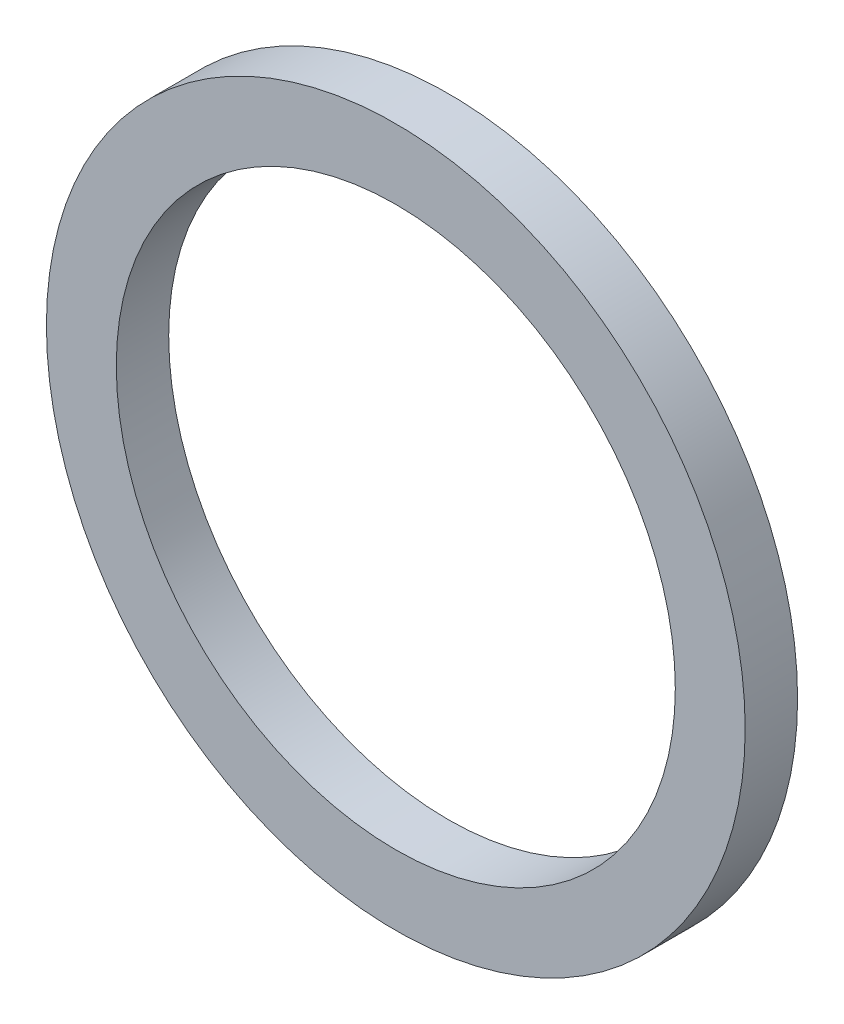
ISO-10303-21;
HEADER;
FILE_DESCRIPTION(('STEP AP214'),'2;1');
FILE_NAME('part.step','',(''),(''),'','','');
FILE_SCHEMA(('AUTOMOTIVE_DESIGN { 1 0 10303 214 1 1 1 1 }'));
ENDSEC;
DATA;
#1=APPLICATION_CONTEXT('core data for automotive mechanical design processes');
#2=APPLICATION_PROTOCOL_DEFINITION('international standard','automotive_design',2000,#1);
#3=PRODUCT_CONTEXT('',#1,'mechanical');
#4=PRODUCT('Part','Part','',(#3));
#5=PRODUCT_RELATED_PRODUCT_CATEGORY('part','',(#4));
#6=PRODUCT_DEFINITION_FORMATION('','',#4);
#7=PRODUCT_DEFINITION_CONTEXT('part definition',#1,'design');
#8=PRODUCT_DEFINITION('design','',#6,#7);
#9=PRODUCT_DEFINITION_SHAPE('','',#8);
#10=(LENGTH_UNIT() NAMED_UNIT(*) SI_UNIT(.MILLI.,.METRE.));
#11=(NAMED_UNIT(*) PLANE_ANGLE_UNIT() SI_UNIT($,.RADIAN.));
#12=(NAMED_UNIT(*) SI_UNIT($,.STERADIAN.) SOLID_ANGLE_UNIT());
#13=UNCERTAINTY_MEASURE_WITH_UNIT(LENGTH_MEASURE(1.E-05),#10,'distance_accuracy_value','');
#14=(GEOMETRIC_REPRESENTATION_CONTEXT(3) GLOBAL_UNCERTAINTY_ASSIGNED_CONTEXT((#13)) GLOBAL_UNIT_ASSIGNED_CONTEXT((#10,
#11,#12)) REPRESENTATION_CONTEXT('',''));
#15=CARTESIAN_POINT('',(0.,0.,0.));
#16=DIRECTION('',(0.,0.,1.));
#17=DIRECTION('',(1.,0.,0.));
#18=AXIS2_PLACEMENT_3D('',#15,#16,#17);
#19=CARTESIAN_POINT('',(0.,0.,3.));
#20=DIRECTION('',(0.,0.,1.));
#21=DIRECTION('',(1.,0.,0.));
#22=AXIS2_PLACEMENT_3D('',#19,#20,#21);
#23=PLANE('',#22);
#24=CARTESIAN_POINT('',(0.,0.,3.));
#25=DIRECTION('',(0.,0.,1.));
#26=DIRECTION('',(1.,0.,0.));
#27=AXIS2_PLACEMENT_3D('',#24,#25,#26);
#28=CIRCLE('',#27,20.);
#29=CARTESIAN_POINT('',(20.,0.,3.));
#30=VERTEX_POINT('',#29);
#31=EDGE_CURVE('E10',#30,#30,#28,.T.);
#32=ORIENTED_EDGE('',*,*,#31,.T.);
#33=EDGE_LOOP('',(#32));
#34=FACE_BOUND('',#33,.T.);
#35=CARTESIAN_POINT('',(0.,0.,3.));
#36=DIRECTION('',(0.,0.,1.));
#37=DIRECTION('',(1.,0.,0.));
#38=AXIS2_PLACEMENT_3D('',#35,#36,#37);
#39=CIRCLE('',#38,16.);
#40=CARTESIAN_POINT('',(16.,0.,3.));
#41=VERTEX_POINT('',#40);
#42=EDGE_CURVE('E33',#41,#41,#39,.T.);
#43=ORIENTED_EDGE('',*,*,#42,.F.);
#44=EDGE_LOOP('',(#43));
#45=FACE_BOUND('',#44,.T.);
#46=ADVANCED_FACE('F22',(#34,#45),#23,.T.);
#47=CARTESIAN_POINT('',(0.,0.,0.));
#48=DIRECTION('',(0.,0.,1.));
#49=DIRECTION('',(1.,0.,0.));
#50=AXIS2_PLACEMENT_3D('',#47,#48,#49);
#51=PLANE('',#50);
#52=CARTESIAN_POINT('',(0.,0.,0.));
#53=DIRECTION('',(0.,0.,1.));
#54=DIRECTION('',(1.,0.,0.));
#55=AXIS2_PLACEMENT_3D('',#52,#53,#54);
#56=CIRCLE('',#55,20.);
#57=CARTESIAN_POINT('',(20.,0.,0.));
#58=VERTEX_POINT('',#57);
#59=EDGE_CURVE('E29',#58,#58,#56,.T.);
#60=ORIENTED_EDGE('',*,*,#59,.F.);
#61=EDGE_LOOP('',(#60));
#62=FACE_BOUND('',#61,.T.);
#63=CARTESIAN_POINT('',(0.,0.,0.));
#64=DIRECTION('',(0.,0.,1.));
#65=DIRECTION('',(1.,0.,0.));
#66=AXIS2_PLACEMENT_3D('',#63,#64,#65);
#67=CIRCLE('',#66,16.);
#68=CARTESIAN_POINT('',(16.,0.,0.));
#69=VERTEX_POINT('',#68);
#70=EDGE_CURVE('E37',#69,#69,#67,.T.);
#71=ORIENTED_EDGE('',*,*,#70,.T.);
#72=EDGE_LOOP('',(#71));
#73=FACE_BOUND('',#72,.T.);
#74=ADVANCED_FACE('F43',(#62,#73),#51,.F.);
#75=CARTESIAN_POINT('',(0.,0.,3.));
#76=DIRECTION('',(0.,0.,-1.));
#77=DIRECTION('',(-1.,0.,0.));
#78=AXIS2_PLACEMENT_3D('',#75,#76,#77);
#79=CYLINDRICAL_SURFACE('',#78,20.);
#80=ORIENTED_EDGE('',*,*,#31,.F.);
#81=EDGE_LOOP('',(#80));
#82=FACE_BOUND('',#81,.T.);
#83=ORIENTED_EDGE('',*,*,#59,.T.);
#84=EDGE_LOOP('',(#83));
#85=FACE_BOUND('',#84,.T.);
#86=ADVANCED_FACE('F24',(#82,#85),#79,.T.);
#87=CARTESIAN_POINT('',(0.,0.,3.));
#88=DIRECTION('',(0.,0.,-1.));
#89=DIRECTION('',(-1.,0.,0.));
#90=AXIS2_PLACEMENT_3D('',#87,#88,#89);
#91=CYLINDRICAL_SURFACE('',#90,16.);
#92=ORIENTED_EDGE('',*,*,#42,.T.);
#93=EDGE_LOOP('',(#92));
#94=FACE_BOUND('',#93,.T.);
#95=ORIENTED_EDGE('',*,*,#70,.F.);
#96=EDGE_LOOP('',(#95));
#97=FACE_BOUND('',#96,.T.);
#98=ADVANCED_FACE('F45',(#94,#97),#91,.F.);
#99=CLOSED_SHELL('',(#46,#74,#86,#98));
#100=MANIFOLD_SOLID_BREP('B2',#99);
#101=ADVANCED_BREP_SHAPE_REPRESENTATION('',(#18,#100),#14);
#102=SHAPE_DEFINITION_REPRESENTATION(#9,#101);
ENDSEC;
END-ISO-10303-21;
